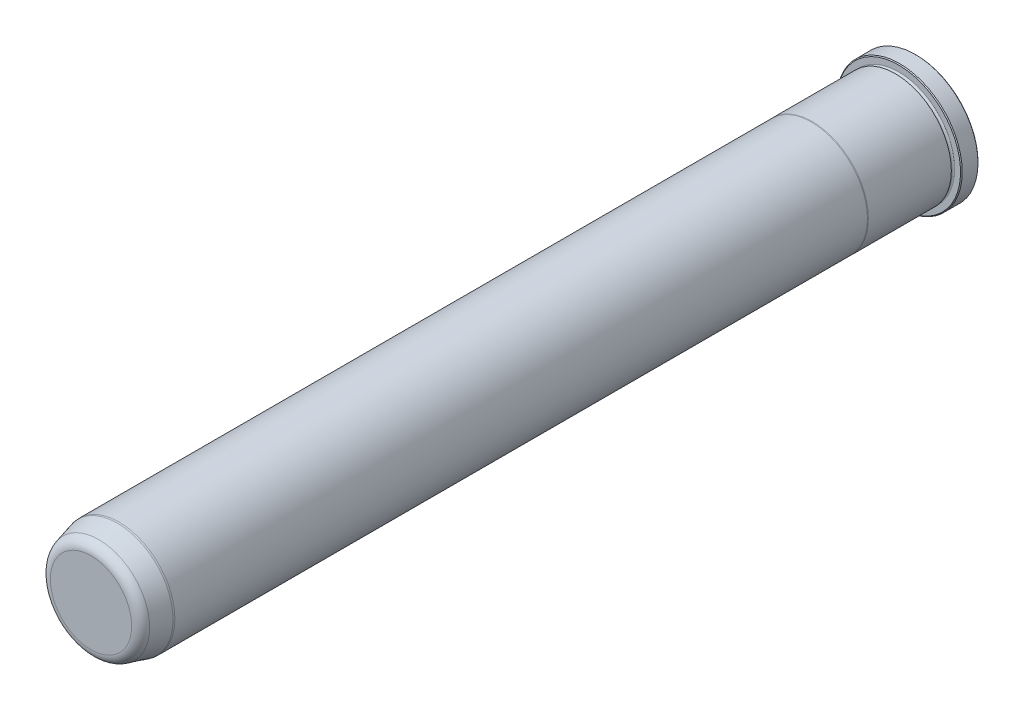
from build123d import *

# Parameters (mm, degrees)
FILLET6_R     = 4.7625
CHAMFER1_SIZE = 0.381


with BuildPart() as part:
    # Sketch1 → Revolve1 (revolve)
    with BuildSketch(Plane(origin=(0, 0, 0), x_dir=(0, 0, -1), z_dir=(1, 0, 0)), mode=Mode.PRIVATE) as revolve1_sk:
        with BuildLine():
            Line((0, 0), (0, 28.448))
            Line((0, 28.448), (-7.9248, 28.448))
            Line((-7.9248, 28.448), (-7.9248, 25.3873))
            ThreePointArc((-7.9248, 25.3873), (-8.6868, 24.6253), (-9.4488, 25.3873))
            Line((-9.4488, 25.3873), (-9.4488, 25.4127))
            Line((-9.4488, 25.4127), (-47.134763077, 25.4127))
            Line((-47.134763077, 25.4127), (-47.498, 25.3873))
            Line((-47.498, 25.3873), (-361.95, 25.3873))
            Line((-361.95, 25.3873), (-362.712, 25.320633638))
            Line((-362.712, 25.320633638), (-374.65, 22.121856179))
            Line((-374.65, 22.121856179), (-374.65, 0))
            Line((-374.65, 0), (0, 0))
        make_face()
    revolve(revolve1_sk.sketch.rotate(Axis((0, 0, 0), (0, 0, -1)), 90), axis=Axis((0, 0, 0), (0, 0, -1)))

    # Fillet6
    fillet6_edges = [part.edges().sort_by_distance(p)[0] for p in [
        (-22.121856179, 0, 374.65),
    ]]
    fillet(fillet6_edges, radius=FILLET6_R)

    # Chamfer1
    chamfer1_edges = [part.edges().sort_by_distance(p)[0] for p in [
        (-28.448, 0, 7.9248),
        (-28.448, 0, 0),
    ]]
    chamfer(chamfer1_edges, length=CHAMFER1_SIZE)


solid = part.part
